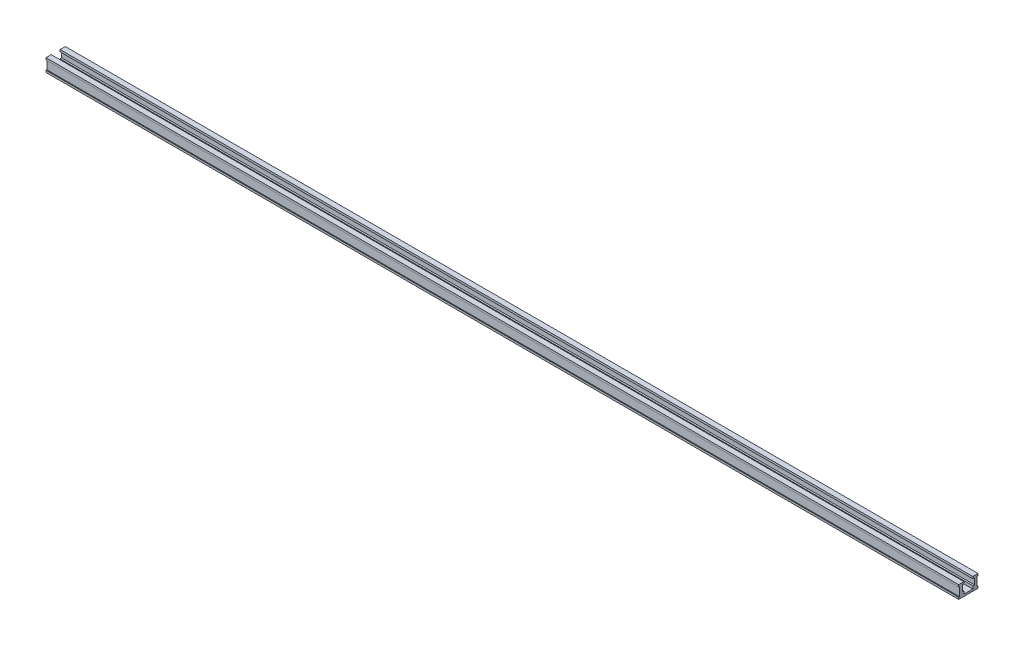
from build123d import *

# Parameters (mm, degrees)
ESTRUSIONE_ESTRUSIONE1_DEPTH = 900


with BuildPart() as part:
    # Schizzo1 → Estrusione-Estrusione1 (new body)
    with BuildSketch(Plane(origin=(0, 0, 0), x_dir=(0, 0, -1), z_dir=(1, 0, 0))):
        Polygon((3.703243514, -9.451076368), (3.703243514, -11.435451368), (-15.346756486, -11.435451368), (-15.346756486, -9.451076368), (-14.553006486, -9.451076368), (-14.553006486, -0.719826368), (-15.346756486, -0.719826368), (-15.346756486, 1.264548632), (-10.187381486, 1.264548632), (-10.187381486, -0.719826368), (-11.774881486, -0.719826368), (-11.774881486, -6.672951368), (-10.187381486, -6.672951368), (-10.187381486, -9.451076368), (-1.456131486, -9.451076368), (-1.456131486, -6.672951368), (0.131368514, -6.672951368), (0.131368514, -0.719826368), (-1.456131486, -0.719826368), (-1.456131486, 1.264548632), (3.703243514, 1.264548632), (3.703243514, -0.719826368), (2.909493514, -0.719826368), (2.909493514, -9.451076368), align=None)
    extrude(amount=ESTRUSIONE_ESTRUSIONE1_DEPTH)


solid = part.part
